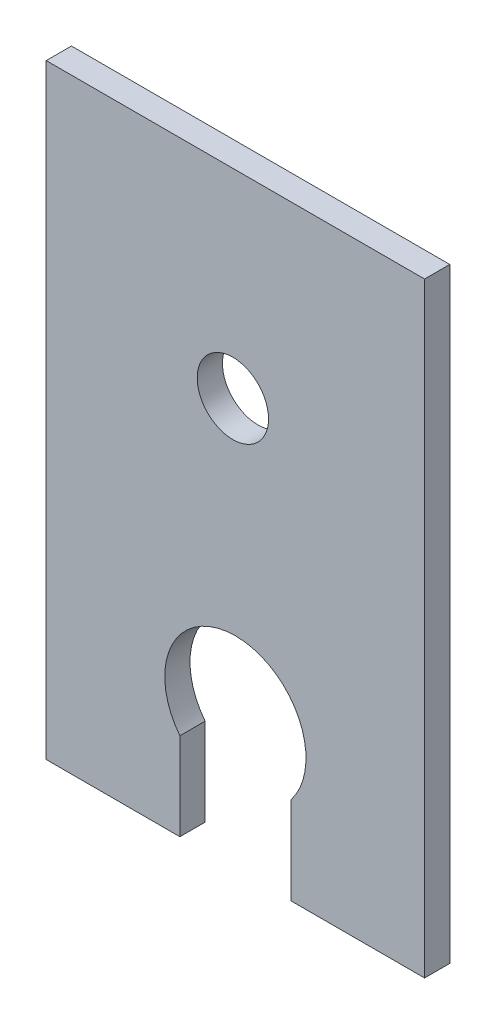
ISO-10303-21;
HEADER;
FILE_DESCRIPTION(('STEP AP214'),'2;1');
FILE_NAME('part.step','',(''),(''),'','','');
FILE_SCHEMA(('AUTOMOTIVE_DESIGN { 1 0 10303 214 1 1 1 1 }'));
ENDSEC;
DATA;
#1=APPLICATION_CONTEXT('core data for automotive mechanical design processes');
#2=APPLICATION_PROTOCOL_DEFINITION('international standard','automotive_design',2000,#1);
#3=PRODUCT_CONTEXT('',#1,'mechanical');
#4=PRODUCT('Part','Part','',(#3));
#5=PRODUCT_RELATED_PRODUCT_CATEGORY('part','',(#4));
#6=PRODUCT_DEFINITION_FORMATION('','',#4);
#7=PRODUCT_DEFINITION_CONTEXT('part definition',#1,'design');
#8=PRODUCT_DEFINITION('design','',#6,#7);
#9=PRODUCT_DEFINITION_SHAPE('','',#8);
#10=(LENGTH_UNIT() NAMED_UNIT(*) SI_UNIT(.MILLI.,.METRE.));
#11=(NAMED_UNIT(*) PLANE_ANGLE_UNIT() SI_UNIT($,.RADIAN.));
#12=(NAMED_UNIT(*) SI_UNIT($,.STERADIAN.) SOLID_ANGLE_UNIT());
#13=UNCERTAINTY_MEASURE_WITH_UNIT(LENGTH_MEASURE(1.E-05),#10,'distance_accuracy_value','');
#14=(GEOMETRIC_REPRESENTATION_CONTEXT(3) GLOBAL_UNCERTAINTY_ASSIGNED_CONTEXT((#13)) GLOBAL_UNIT_ASSIGNED_CONTEXT((#10,
#11,#12)) REPRESENTATION_CONTEXT('',''));
#15=CARTESIAN_POINT('',(0.,0.,0.));
#16=DIRECTION('',(0.,0.,1.));
#17=DIRECTION('',(1.,0.,0.));
#18=AXIS2_PLACEMENT_3D('',#15,#16,#17);
#19=CARTESIAN_POINT('',(0.,0.,10.));
#20=DIRECTION('',(0.,1.,0.));
#21=DIRECTION('',(0.,0.,1.));
#22=AXIS2_PLACEMENT_3D('',#19,#20,#21);
#23=PLANE('',#22);
#24=DIRECTION('',(1.,0.,0.));
#25=VECTOR('',#24,1.);
#26=CARTESIAN_POINT('',(0.,0.,0.));
#27=LINE('',#26,#25);
#28=CARTESIAN_POINT('',(0.,0.,0.));
#29=VERTEX_POINT('',#28);
#30=CARTESIAN_POINT('',(53.,0.,0.));
#31=VERTEX_POINT('',#30);
#32=EDGE_CURVE('E119',#29,#31,#27,.T.);
#33=ORIENTED_EDGE('',*,*,#32,.T.);
#34=DIRECTION('',(0.,0.,1.));
#35=VECTOR('',#34,1.);
#36=CARTESIAN_POINT('',(53.,0.,0.));
#37=LINE('',#36,#35);
#38=CARTESIAN_POINT('',(53.,0.,10.0000000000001));
#39=VERTEX_POINT('',#38);
#40=EDGE_CURVE('E107',#31,#39,#37,.T.);
#41=ORIENTED_EDGE('',*,*,#40,.T.);
#42=DIRECTION('',(1.,0.,0.));
#43=VECTOR('',#42,1.);
#44=CARTESIAN_POINT('',(0.,0.,10.));
#45=LINE('',#44,#43);
#46=CARTESIAN_POINT('',(0.,0.,10.));
#47=VERTEX_POINT('',#46);
#48=EDGE_CURVE('E118',#47,#39,#45,.T.);
#49=ORIENTED_EDGE('',*,*,#48,.F.);
#50=DIRECTION('',(0.,0.,-1.));
#51=VECTOR('',#50,1.);
#52=CARTESIAN_POINT('',(0.,0.,10.));
#53=LINE('',#52,#51);
#54=EDGE_CURVE('E12',#47,#29,#53,.T.);
#55=ORIENTED_EDGE('',*,*,#54,.T.);
#56=EDGE_LOOP('',(#33,#41,#49,#55));
#57=FACE_BOUND('',#56,.T.);
#58=ADVANCED_FACE('F38',(#57),#23,.F.);
#59=CARTESIAN_POINT('',(0.,0.,10.));
#60=DIRECTION('',(1.,0.,0.));
#61=DIRECTION('',(0.,0.,-1.));
#62=AXIS2_PLACEMENT_3D('',#59,#60,#61);
#63=PLANE('',#62);
#64=DIRECTION('',(0.,-1.,0.));
#65=VECTOR('',#64,1.);
#66=CARTESIAN_POINT('',(0.,0.,0.));
#67=LINE('',#66,#65);
#68=CARTESIAN_POINT('',(0.,240.,0.));
#69=VERTEX_POINT('',#68);
#70=EDGE_CURVE('E160',#69,#29,#67,.T.);
#71=ORIENTED_EDGE('',*,*,#70,.T.);
#72=ORIENTED_EDGE('',*,*,#54,.F.);
#73=DIRECTION('',(0.,-1.,0.));
#74=VECTOR('',#73,1.);
#75=CARTESIAN_POINT('',(0.,0.,10.));
#76=LINE('',#75,#74);
#77=CARTESIAN_POINT('',(0.,240.,10.));
#78=VERTEX_POINT('',#77);
#79=EDGE_CURVE('E124',#78,#47,#76,.T.);
#80=ORIENTED_EDGE('',*,*,#79,.F.);
#81=DIRECTION('',(0.,0.,-1.));
#82=VECTOR('',#81,1.);
#83=CARTESIAN_POINT('',(0.,240.,10.));
#84=LINE('',#83,#82);
#85=EDGE_CURVE('E134',#78,#69,#84,.T.);
#86=ORIENTED_EDGE('',*,*,#85,.T.);
#87=EDGE_LOOP('',(#71,#72,#80,#86));
#88=FACE_BOUND('',#87,.T.);
#89=ADVANCED_FACE('F40',(#88),#63,.F.);
#90=CARTESIAN_POINT('',(97.,0.,10.0000000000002));
#91=VERTEX_POINT('',#90);
#92=CARTESIAN_POINT('',(150.,0.,10.0000000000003));
#93=VERTEX_POINT('',#92);
#94=EDGE_CURVE('E127',#91,#93,#45,.T.);
#95=ORIENTED_EDGE('',*,*,#94,.F.);
#96=DIRECTION('',(0.,0.,1.));
#97=VECTOR('',#96,1.);
#98=CARTESIAN_POINT('',(97.,0.,1.72306613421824E-13));
#99=LINE('',#98,#97);
#100=CARTESIAN_POINT('',(97.,0.,1.72306613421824E-13));
#101=VERTEX_POINT('',#100);
#102=EDGE_CURVE('E120',#101,#91,#99,.T.);
#103=ORIENTED_EDGE('',*,*,#102,.F.);
#104=CARTESIAN_POINT('',(150.,0.,2.66453525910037E-13));
#105=VERTEX_POINT('',#104);
#106=EDGE_CURVE('E154',#101,#105,#27,.T.);
#107=ORIENTED_EDGE('',*,*,#106,.T.);
#108=DIRECTION('',(0.,0.,-1.));
#109=VECTOR('',#108,1.);
#110=CARTESIAN_POINT('',(150.,0.,10.0000000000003));
#111=LINE('',#110,#109);
#112=EDGE_CURVE('E46',#93,#105,#111,.T.);
#113=ORIENTED_EDGE('',*,*,#112,.F.);
#114=EDGE_LOOP('',(#95,#103,#107,#113));
#115=FACE_BOUND('',#114,.T.);
#116=ADVANCED_FACE('F197',(#115),#23,.F.);
#117=CARTESIAN_POINT('',(150.,0.,10.0000000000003));
#118=DIRECTION('',(-1.,0.,0.));
#119=DIRECTION('',(0.,0.,1.));
#120=AXIS2_PLACEMENT_3D('',#117,#118,#119);
#121=PLANE('',#120);
#122=DIRECTION('',(0.,1.,0.));
#123=VECTOR('',#122,1.);
#124=CARTESIAN_POINT('',(150.,0.,2.66453525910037E-13));
#125=LINE('',#124,#123);
#126=CARTESIAN_POINT('',(150.,240.,2.66453525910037E-13));
#127=VERTEX_POINT('',#126);
#128=EDGE_CURVE('E146',#105,#127,#125,.T.);
#129=ORIENTED_EDGE('',*,*,#128,.T.);
#130=DIRECTION('',(0.,0.,-1.));
#131=VECTOR('',#130,1.);
#132=CARTESIAN_POINT('',(150.,240.,10.0000000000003));
#133=LINE('',#132,#131);
#134=CARTESIAN_POINT('',(150.,240.,10.0000000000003));
#135=VERTEX_POINT('',#134);
#136=EDGE_CURVE('E137',#135,#127,#133,.T.);
#137=ORIENTED_EDGE('',*,*,#136,.F.);
#138=DIRECTION('',(0.,1.,0.));
#139=VECTOR('',#138,1.);
#140=CARTESIAN_POINT('',(150.,0.,10.0000000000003));
#141=LINE('',#140,#139);
#142=EDGE_CURVE('E126',#93,#135,#141,.T.);
#143=ORIENTED_EDGE('',*,*,#142,.F.);
#144=ORIENTED_EDGE('',*,*,#112,.T.);
#145=EDGE_LOOP('',(#129,#137,#143,#144));
#146=FACE_BOUND('',#145,.T.);
#147=ADVANCED_FACE('F144',(#146),#121,.F.);
#148=CARTESIAN_POINT('',(0.,240.,10.));
#149=DIRECTION('',(0.,-1.,0.));
#150=DIRECTION('',(0.,0.,-1.));
#151=AXIS2_PLACEMENT_3D('',#148,#149,#150);
#152=PLANE('',#151);
#153=DIRECTION('',(-1.,0.,0.));
#154=VECTOR('',#153,1.);
#155=CARTESIAN_POINT('',(0.,240.,0.));
#156=LINE('',#155,#154);
#157=EDGE_CURVE('E156',#127,#69,#156,.T.);
#158=ORIENTED_EDGE('',*,*,#157,.T.);
#159=ORIENTED_EDGE('',*,*,#85,.F.);
#160=DIRECTION('',(-1.,0.,0.));
#161=VECTOR('',#160,1.);
#162=CARTESIAN_POINT('',(0.,240.,10.));
#163=LINE('',#162,#161);
#164=EDGE_CURVE('E61',#135,#78,#163,.T.);
#165=ORIENTED_EDGE('',*,*,#164,.F.);
#166=ORIENTED_EDGE('',*,*,#136,.T.);
#167=EDGE_LOOP('',(#158,#159,#165,#166));
#168=FACE_BOUND('',#167,.T.);
#169=ADVANCED_FACE('F186',(#168),#152,.F.);
#170=CARTESIAN_POINT('',(0.,240.,10.));
#171=DIRECTION('',(0.,0.,-1.));
#172=DIRECTION('',(-1.,0.,0.));
#173=AXIS2_PLACEMENT_3D('',#170,#171,#172);
#174=PLANE('',#173);
#175=CARTESIAN_POINT('',(74.,161.,10.));
#176=DIRECTION('',(0.,0.,1.));
#177=DIRECTION('',(1.,0.,0.));
#178=AXIS2_PLACEMENT_3D('',#175,#176,#177);
#179=CIRCLE('',#178,14.1421356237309);
#180=CARTESIAN_POINT('',(88.142135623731,161.,10.));
#181=VERTEX_POINT('',#180);
#182=EDGE_CURVE('E179',#181,#181,#179,.T.);
#183=ORIENTED_EDGE('',*,*,#182,.F.);
#184=EDGE_LOOP('',(#183));
#185=FACE_BOUND('',#184,.T.);
#186=ORIENTED_EDGE('',*,*,#48,.T.);
#187=DIRECTION('',(0.,-1.,0.));
#188=VECTOR('',#187,1.);
#189=CARTESIAN_POINT('',(53.,0.,10.0000000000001));
#190=LINE('',#189,#188);
#191=CARTESIAN_POINT('',(53.,34.6794919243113,10.0000000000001));
#192=VERTEX_POINT('',#191);
#193=EDGE_CURVE('E103',#192,#39,#190,.T.);
#194=ORIENTED_EDGE('',*,*,#193,.F.);
#195=CARTESIAN_POINT('',(75.,52.,10.0000000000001));
#196=DIRECTION('',(0.,0.,1.));
#197=DIRECTION('',(1.,0.,0.));
#198=AXIS2_PLACEMENT_3D('',#195,#196,#197);
#199=CIRCLE('',#198,28.);
#200=CARTESIAN_POINT('',(97.,34.6794919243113,10.0000000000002));
#201=VERTEX_POINT('',#200);
#202=EDGE_CURVE('E173',#201,#192,#199,.T.);
#203=ORIENTED_EDGE('',*,*,#202,.F.);
#204=DIRECTION('',(0.,1.,0.));
#205=VECTOR('',#204,1.);
#206=CARTESIAN_POINT('',(97.,0.,10.0000000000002));
#207=LINE('',#206,#205);
#208=EDGE_CURVE('E113',#91,#201,#207,.T.);
#209=ORIENTED_EDGE('',*,*,#208,.F.);
#210=ORIENTED_EDGE('',*,*,#94,.T.);
#211=ORIENTED_EDGE('',*,*,#142,.T.);
#212=ORIENTED_EDGE('',*,*,#164,.T.);
#213=ORIENTED_EDGE('',*,*,#79,.T.);
#214=EDGE_LOOP('',(#186,#194,#203,#209,#210,#211,#212,#213));
#215=FACE_BOUND('',#214,.T.);
#216=ADVANCED_FACE('F122',(#185,#215),#174,.F.);
#217=CARTESIAN_POINT('',(0.,240.,0.));
#218=DIRECTION('',(0.,0.,-1.));
#219=DIRECTION('',(-1.,0.,0.));
#220=AXIS2_PLACEMENT_3D('',#217,#218,#219);
#221=PLANE('',#220);
#222=CARTESIAN_POINT('',(74.,161.,0.));
#223=DIRECTION('',(0.,0.,1.));
#224=DIRECTION('',(1.,0.,0.));
#225=AXIS2_PLACEMENT_3D('',#222,#223,#224);
#226=CIRCLE('',#225,14.1421356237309);
#227=CARTESIAN_POINT('',(88.142135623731,161.,0.));
#228=VERTEX_POINT('',#227);
#229=EDGE_CURVE('E114',#228,#228,#226,.T.);
#230=ORIENTED_EDGE('',*,*,#229,.T.);
#231=EDGE_LOOP('',(#230));
#232=FACE_BOUND('',#231,.T.);
#233=DIRECTION('',(0.,-1.,0.));
#234=VECTOR('',#233,1.);
#235=CARTESIAN_POINT('',(53.,0.,0.));
#236=LINE('',#235,#234);
#237=CARTESIAN_POINT('',(53.,34.6794919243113,0.));
#238=VERTEX_POINT('',#237);
#239=EDGE_CURVE('E171',#238,#31,#236,.T.);
#240=ORIENTED_EDGE('',*,*,#239,.T.);
#241=ORIENTED_EDGE('',*,*,#32,.F.);
#242=ORIENTED_EDGE('',*,*,#70,.F.);
#243=ORIENTED_EDGE('',*,*,#157,.F.);
#244=ORIENTED_EDGE('',*,*,#128,.F.);
#245=ORIENTED_EDGE('',*,*,#106,.F.);
#246=DIRECTION('',(0.,1.,0.));
#247=VECTOR('',#246,1.);
#248=CARTESIAN_POINT('',(97.,0.,1.72306613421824E-13));
#249=LINE('',#248,#247);
#250=CARTESIAN_POINT('',(97.,34.6794919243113,1.72306613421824E-13));
#251=VERTEX_POINT('',#250);
#252=EDGE_CURVE('E169',#101,#251,#249,.T.);
#253=ORIENTED_EDGE('',*,*,#252,.T.);
#254=CARTESIAN_POINT('',(75.,52.,1.33226762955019E-13));
#255=DIRECTION('',(0.,0.,1.));
#256=DIRECTION('',(1.,0.,0.));
#257=AXIS2_PLACEMENT_3D('',#254,#255,#256);
#258=CIRCLE('',#257,28.);
#259=EDGE_CURVE('E53',#251,#238,#258,.T.);
#260=ORIENTED_EDGE('',*,*,#259,.T.);
#261=EDGE_LOOP('',(#240,#241,#242,#243,#244,#245,#253,#260));
#262=FACE_BOUND('',#261,.T.);
#263=ADVANCED_FACE('F152',(#232,#262),#221,.T.);
#264=CARTESIAN_POINT('',(53.,0.,0.));
#265=DIRECTION('',(-1.,0.,0.));
#266=DIRECTION('',(0.,0.,1.));
#267=AXIS2_PLACEMENT_3D('',#264,#265,#266);
#268=PLANE('',#267);
#269=ORIENTED_EDGE('',*,*,#193,.T.);
#270=ORIENTED_EDGE('',*,*,#40,.F.);
#271=ORIENTED_EDGE('',*,*,#239,.F.);
#272=DIRECTION('',(0.,0.,1.));
#273=VECTOR('',#272,1.);
#274=CARTESIAN_POINT('',(53.,34.6794919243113,0.));
#275=LINE('',#274,#273);
#276=EDGE_CURVE('E109',#238,#192,#275,.T.);
#277=ORIENTED_EDGE('',*,*,#276,.T.);
#278=EDGE_LOOP('',(#269,#270,#271,#277));
#279=FACE_BOUND('',#278,.T.);
#280=ADVANCED_FACE('F105',(#279),#268,.F.);
#281=CARTESIAN_POINT('',(75.,52.,1.33226762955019E-13));
#282=DIRECTION('',(0.,0.,1.));
#283=DIRECTION('',(1.,0.,0.));
#284=AXIS2_PLACEMENT_3D('',#281,#282,#283);
#285=CYLINDRICAL_SURFACE('',#284,28.);
#286=ORIENTED_EDGE('',*,*,#202,.T.);
#287=ORIENTED_EDGE('',*,*,#276,.F.);
#288=ORIENTED_EDGE('',*,*,#259,.F.);
#289=DIRECTION('',(0.,0.,1.));
#290=VECTOR('',#289,1.);
#291=CARTESIAN_POINT('',(97.,34.6794919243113,1.72306613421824E-13));
#292=LINE('',#291,#290);
#293=EDGE_CURVE('E164',#251,#201,#292,.T.);
#294=ORIENTED_EDGE('',*,*,#293,.T.);
#295=EDGE_LOOP('',(#286,#287,#288,#294));
#296=FACE_BOUND('',#295,.T.);
#297=ADVANCED_FACE('F211',(#296),#285,.F.);
#298=CARTESIAN_POINT('',(97.,0.,1.72306613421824E-13));
#299=DIRECTION('',(1.,0.,0.));
#300=DIRECTION('',(0.,0.,-1.));
#301=AXIS2_PLACEMENT_3D('',#298,#299,#300);
#302=PLANE('',#301);
#303=ORIENTED_EDGE('',*,*,#208,.T.);
#304=ORIENTED_EDGE('',*,*,#293,.F.);
#305=ORIENTED_EDGE('',*,*,#252,.F.);
#306=ORIENTED_EDGE('',*,*,#102,.T.);
#307=EDGE_LOOP('',(#303,#304,#305,#306));
#308=FACE_BOUND('',#307,.T.);
#309=ADVANCED_FACE('F210',(#308),#302,.F.);
#310=CARTESIAN_POINT('',(74.,161.,0.));
#311=DIRECTION('',(0.,0.,1.));
#312=DIRECTION('',(1.,0.,0.));
#313=AXIS2_PLACEMENT_3D('',#310,#311,#312);
#314=CYLINDRICAL_SURFACE('',#313,14.1421356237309);
#315=ORIENTED_EDGE('',*,*,#229,.F.);
#316=EDGE_LOOP('',(#315));
#317=FACE_BOUND('',#316,.T.);
#318=ORIENTED_EDGE('',*,*,#182,.T.);
#319=EDGE_LOOP('',(#318));
#320=FACE_BOUND('',#319,.T.);
#321=ADVANCED_FACE('F183',(#317,#320),#314,.F.);
#322=CLOSED_SHELL('',(#58,#89,#116,#147,#169,#216,#263,#280,#297,#309,#321));
#323=MANIFOLD_SOLID_BREP('B2',#322);
#324=ADVANCED_BREP_SHAPE_REPRESENTATION('',(#18,#323),#14);
#325=SHAPE_DEFINITION_REPRESENTATION(#9,#324);
ENDSEC;
END-ISO-10303-21;
